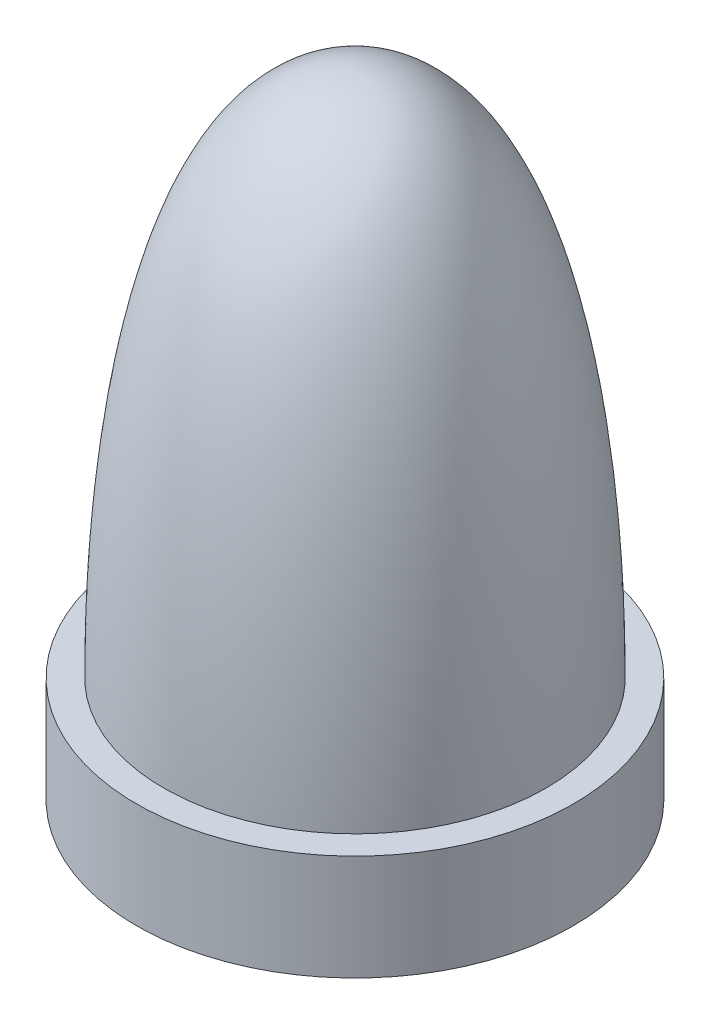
ISO-10303-21;
HEADER;
FILE_DESCRIPTION(('STEP AP214'),'2;1');
FILE_NAME('part.step','',(''),(''),'','','');
FILE_SCHEMA(('AUTOMOTIVE_DESIGN { 1 0 10303 214 1 1 1 1 }'));
ENDSEC;
DATA;
#1=APPLICATION_CONTEXT('core data for automotive mechanical design processes');
#2=APPLICATION_PROTOCOL_DEFINITION('international standard','automotive_design',2000,#1);
#3=PRODUCT_CONTEXT('',#1,'mechanical');
#4=PRODUCT('Part','Part','',(#3));
#5=PRODUCT_RELATED_PRODUCT_CATEGORY('part','',(#4));
#6=PRODUCT_DEFINITION_FORMATION('','',#4);
#7=PRODUCT_DEFINITION_CONTEXT('part definition',#1,'design');
#8=PRODUCT_DEFINITION('design','',#6,#7);
#9=PRODUCT_DEFINITION_SHAPE('','',#8);
#10=(LENGTH_UNIT() NAMED_UNIT(*) SI_UNIT(.MILLI.,.METRE.));
#11=(NAMED_UNIT(*) PLANE_ANGLE_UNIT() SI_UNIT($,.RADIAN.));
#12=(NAMED_UNIT(*) SI_UNIT($,.STERADIAN.) SOLID_ANGLE_UNIT());
#13=UNCERTAINTY_MEASURE_WITH_UNIT(LENGTH_MEASURE(1.E-05),#10,'distance_accuracy_value','');
#14=(GEOMETRIC_REPRESENTATION_CONTEXT(3) GLOBAL_UNCERTAINTY_ASSIGNED_CONTEXT((#13)) GLOBAL_UNIT_ASSIGNED_CONTEXT((#10,
#11,#12)) REPRESENTATION_CONTEXT('',''));
#15=CARTESIAN_POINT('',(0.,0.,0.));
#16=DIRECTION('',(0.,0.,1.));
#17=DIRECTION('',(1.,0.,0.));
#18=AXIS2_PLACEMENT_3D('',#15,#16,#17);
#19=CARTESIAN_POINT('',(0.,0.,0.));
#20=DIRECTION('',(0.,-1.,0.));
#21=DIRECTION('',(0.,0.,-1.));
#22=AXIS2_PLACEMENT_3D('',#19,#20,#21);
#23=PLANE('',#22);
#24=CARTESIAN_POINT('',(0.,0.,0.));
#25=DIRECTION('',(0.,-1.,0.));
#26=DIRECTION('',(0.,0.,-1.));
#27=AXIS2_PLACEMENT_3D('',#24,#25,#26);
#28=CIRCLE('',#27,2.1);
#29=CARTESIAN_POINT('',(0.,0.,-2.1));
#30=VERTEX_POINT('',#29);
#31=EDGE_CURVE('E62',#30,#30,#28,.T.);
#32=ORIENTED_EDGE('',*,*,#31,.F.);
#33=EDGE_LOOP('',(#32));
#34=FACE_BOUND('',#33,.T.);
#35=CARTESIAN_POINT('',(0.,0.,0.));
#36=DIRECTION('',(0.,-1.,0.));
#37=DIRECTION('',(0.,0.,-1.));
#38=AXIS2_PLACEMENT_3D('',#35,#36,#37);
#39=CIRCLE('',#38,6.);
#40=CARTESIAN_POINT('',(0.,0.,-6.));
#41=VERTEX_POINT('',#40);
#42=EDGE_CURVE('E11',#41,#41,#39,.T.);
#43=ORIENTED_EDGE('',*,*,#42,.T.);
#44=EDGE_LOOP('',(#43));
#45=FACE_BOUND('',#44,.T.);
#46=ADVANCED_FACE('F38',(#34,#45),#23,.T.);
#47=CARTESIAN_POINT('',(0.,0.,0.));
#48=DIRECTION('',(0.,-1.,0.));
#49=DIRECTION('',(0.,0.,-1.));
#50=AXIS2_PLACEMENT_3D('',#47,#48,#49);
#51=CYLINDRICAL_SURFACE('',#50,6.);
#52=CARTESIAN_POINT('',(0.,2.9,0.));
#53=DIRECTION('',(0.,-1.,0.));
#54=DIRECTION('',(0.,0.,-1.));
#55=AXIS2_PLACEMENT_3D('',#52,#53,#54);
#56=CIRCLE('',#55,6.);
#57=CARTESIAN_POINT('',(0.,2.9,-6.));
#58=VERTEX_POINT('',#57);
#59=EDGE_CURVE('E45',#58,#58,#56,.T.);
#60=ORIENTED_EDGE('',*,*,#59,.T.);
#61=EDGE_LOOP('',(#60));
#62=FACE_BOUND('',#61,.T.);
#63=ORIENTED_EDGE('',*,*,#42,.F.);
#64=EDGE_LOOP('',(#63));
#65=FACE_BOUND('',#64,.T.);
#66=ADVANCED_FACE('F81',(#62,#65),#51,.T.);
#67=CARTESIAN_POINT('',(6.,2.9,0.));
#68=DIRECTION('',(0.,1.,0.));
#69=DIRECTION('',(0.,0.,1.));
#70=AXIS2_PLACEMENT_3D('',#67,#68,#69);
#71=PLANE('',#70);
#72=CARTESIAN_POINT('',(0.,2.9,0.));
#73=DIRECTION('',(0.,-1.,0.));
#74=DIRECTION('',(0.,0.,-1.));
#75=AXIS2_PLACEMENT_3D('',#72,#73,#74);
#76=CIRCLE('',#75,5.25);
#77=CARTESIAN_POINT('',(0.,2.9,-5.25));
#78=VERTEX_POINT('',#77);
#79=EDGE_CURVE('E61',#78,#78,#76,.T.);
#80=ORIENTED_EDGE('',*,*,#79,.T.);
#81=EDGE_LOOP('',(#80));
#82=FACE_BOUND('',#81,.T.);
#83=ORIENTED_EDGE('',*,*,#59,.F.);
#84=EDGE_LOOP('',(#83));
#85=FACE_BOUND('',#84,.T.);
#86=ADVANCED_FACE('F78',(#82,#85),#71,.T.);
#87=CARTESIAN_POINT('',(5.25,2.9,0.));
#88=CARTESIAN_POINT('',(5.25,9.0340184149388,0.));
#89=CARTESIAN_POINT('',(4.175265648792,17.27,0.));
#90=CARTESIAN_POINT('',(0.,17.27,0.));
#91=B_SPLINE_CURVE_WITH_KNOTS('',3,(#87,#88,#89,#90),.UNSPECIFIED.,.F.,.F.,(4,4),(0.,1.),.UNSPECIFIED.);
#92=CARTESIAN_POINT('',(0.,0.,0.));
#93=DIRECTION('',(0.,-1.,0.));
#94=AXIS1_PLACEMENT('',#92,#93);
#95=SURFACE_OF_REVOLUTION('',#91,#94);
#96=CARTESIAN_POINT('',(0.,17.27,0.));
#97=VERTEX_POINT('',#96);
#98=VERTEX_LOOP('',#97);
#99=FACE_BOUND('',#98,.T.);
#100=ORIENTED_EDGE('',*,*,#79,.F.);
#101=EDGE_LOOP('',(#100));
#102=FACE_BOUND('',#101,.T.);
#103=ADVANCED_FACE('F55',(#99,#102),#95,.F.);
#104=CARTESIAN_POINT('',(0.,14.,0.));
#105=DIRECTION('',(0.,-1.,0.));
#106=DIRECTION('',(0.,0.,-1.));
#107=AXIS2_PLACEMENT_3D('',#104,#105,#106);
#108=CONICAL_SURFACE('',#107,2.1,1.0471975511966);
#109=CARTESIAN_POINT('',(0.,15.2124355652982,0.));
#110=VERTEX_POINT('',#109);
#111=VERTEX_LOOP('',#110);
#112=FACE_BOUND('',#111,.T.);
#113=CARTESIAN_POINT('',(0.,14.,0.));
#114=DIRECTION('',(0.,-1.,0.));
#115=DIRECTION('',(0.,0.,-1.));
#116=AXIS2_PLACEMENT_3D('',#113,#114,#115);
#117=CIRCLE('',#116,2.1);
#118=CARTESIAN_POINT('',(0.,14.,-2.1));
#119=VERTEX_POINT('',#118);
#120=EDGE_CURVE('E59',#119,#119,#117,.T.);
#121=ORIENTED_EDGE('',*,*,#120,.T.);
#122=EDGE_LOOP('',(#121));
#123=FACE_BOUND('',#122,.T.);
#124=ADVANCED_FACE('F51',(#112,#123),#108,.F.);
#125=CARTESIAN_POINT('',(0.,0.,0.));
#126=DIRECTION('',(0.,-1.,0.));
#127=DIRECTION('',(0.,0.,-1.));
#128=AXIS2_PLACEMENT_3D('',#125,#126,#127);
#129=CYLINDRICAL_SURFACE('',#128,2.1);
#130=ORIENTED_EDGE('',*,*,#120,.F.);
#131=EDGE_LOOP('',(#130));
#132=FACE_BOUND('',#131,.T.);
#133=ORIENTED_EDGE('',*,*,#31,.T.);
#134=EDGE_LOOP('',(#133));
#135=FACE_BOUND('',#134,.T.);
#136=ADVANCED_FACE('F54',(#132,#135),#129,.F.);
#137=CLOSED_SHELL('',(#46,#66,#86,#103,#124,#136));
#138=MANIFOLD_SOLID_BREP('B2',#137);
#139=ADVANCED_BREP_SHAPE_REPRESENTATION('',(#18,#138),#14);
#140=SHAPE_DEFINITION_REPRESENTATION(#9,#139);
ENDSEC;
END-ISO-10303-21;
